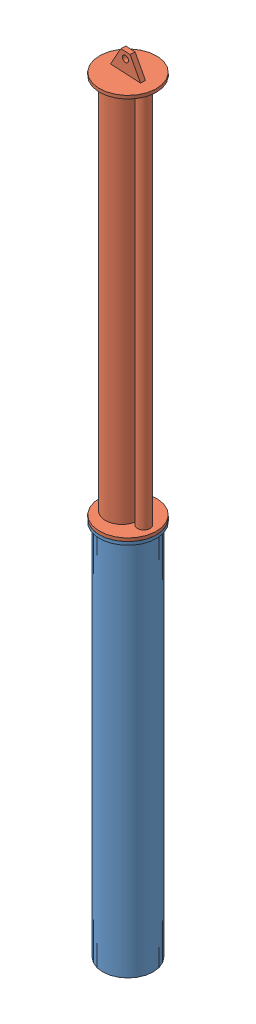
SolidWorks assembly PTO.SLDASM, configuration Default (file format 7000). Lengths in mm.
Overall size (239.68 3150.81 239.68).
2 component instances, 2 part files, 2 mates.
Components (placement in the parent):
- TetherGuide-1: TetherGuide.SLDPRT [Default] at (452.7375 1483.32 1165.7157) size (228.6 1525.21 228.6)
- PTO-1: PTO.SLDPRT [Default] at (510.2449 1496.02 1168.5779) x (0.998764 0 0.04971) z (-0.04971 0 0.998764) size (228.6 1625.6 228.6)
Mates (geometry in assembly coordinates):
- Concentric1: concentric anti-aligned: cylinder of TetherGuide-1 through (452.7375 1483.32 1165.7157) axis (0 -1 0) radius 114.3; cylinder of PTO-1 through (452.7375 1483.32 1165.7157) axis (0 1 0) radius 114.3
- Coincident1: coincident anti-aligned: plane of TetherGuide-1 through (452.7375 1483.32 1073.6407) normal (0 1 0); plane of PTO-1 through (452.7375 1483.32 1165.7157) normal (0 -1 0)
